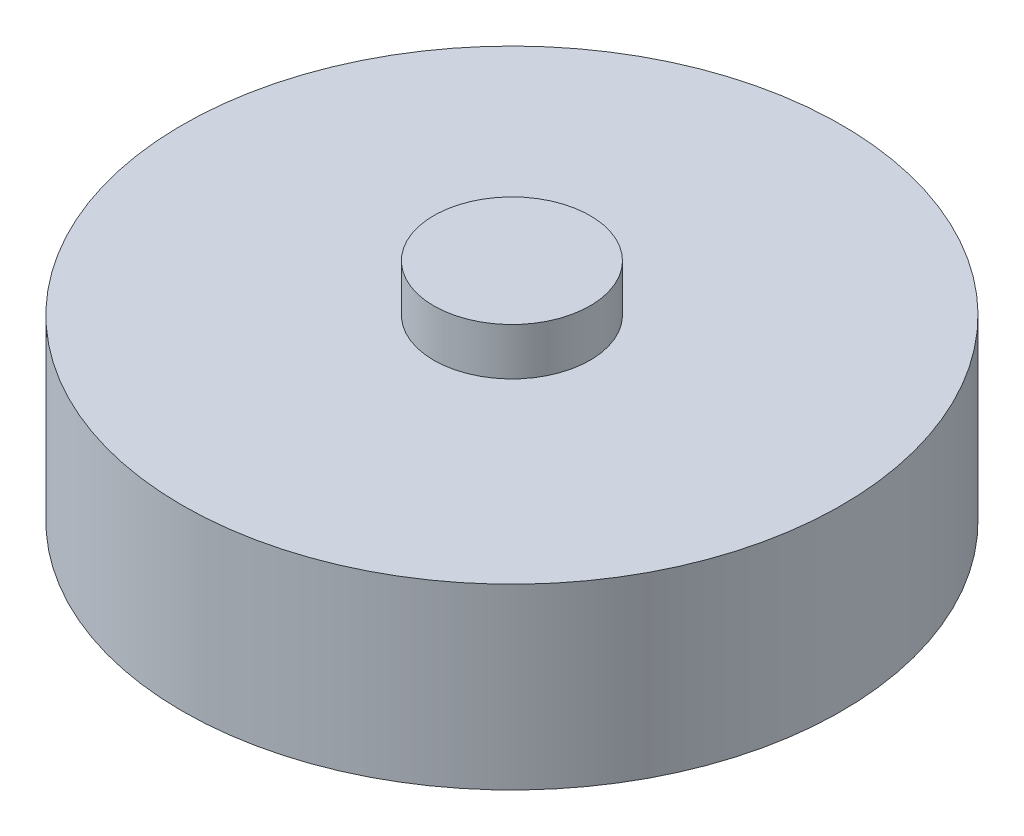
from build123d import *

# Parameters (mm, degrees)
SKETCH1_R           = 4.826
BOSS_EXTRUDE1_DEPTH = 2.61
SKETCH2_R           = 1.145
BOSS_EXTRUDE2_DEPTH = 0.69


with BuildPart() as part:
    # Sketch1 → Boss-Extrude1 (new body)
    with BuildSketch(Plane(origin=(0, 0, 0), x_dir=(1, 0, 0), z_dir=(0, 1, 0))):
        with Locations(Location((0, 0, 0), (0, 0, 270))):
            Circle(SKETCH1_R)
    extrude(amount=BOSS_EXTRUDE1_DEPTH)

    # Sketch2 → Boss-Extrude2 (add)
    with BuildSketch(Plane(origin=(0, 2.61, 0), x_dir=(1, 0, 0), z_dir=(0, 1, 0))):
        with Locations(Location((0, 0, 0), (0, 0, 270))):
            Circle(SKETCH2_R)
    extrude(amount=BOSS_EXTRUDE2_DEPTH)


solid = part.part
